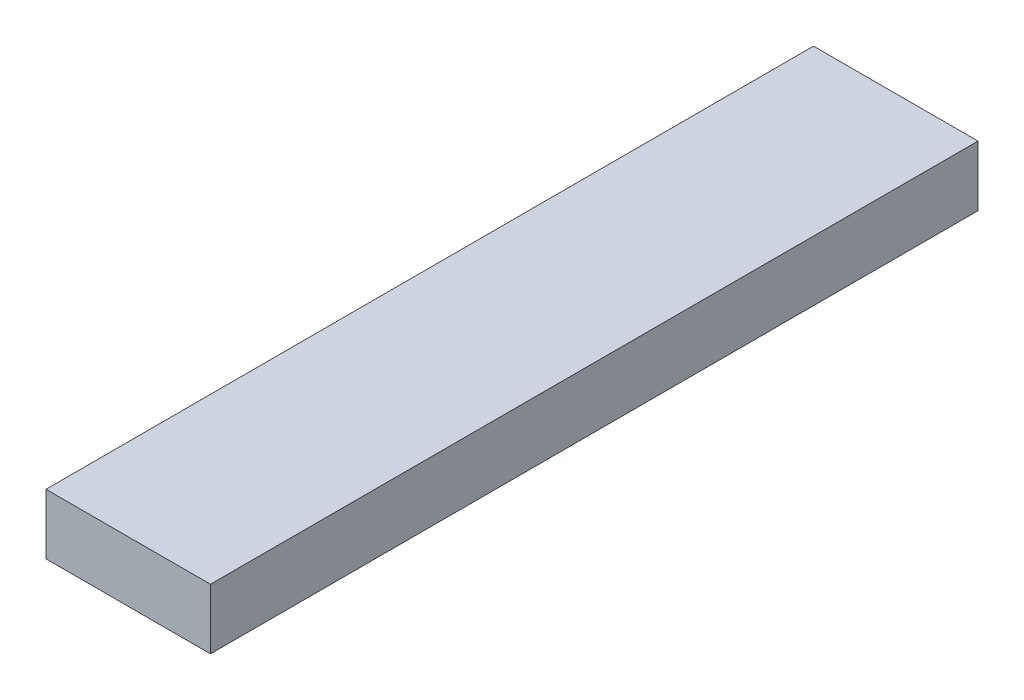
ISO-10303-21;
HEADER;
FILE_DESCRIPTION(('STEP AP214'),'2;1');
FILE_NAME('part.step','',(''),(''),'','','');
FILE_SCHEMA(('AUTOMOTIVE_DESIGN { 1 0 10303 214 1 1 1 1 }'));
ENDSEC;
DATA;
#1=APPLICATION_CONTEXT('core data for automotive mechanical design processes');
#2=APPLICATION_PROTOCOL_DEFINITION('international standard','automotive_design',2000,#1);
#3=PRODUCT_CONTEXT('',#1,'mechanical');
#4=PRODUCT('Part','Part','',(#3));
#5=PRODUCT_RELATED_PRODUCT_CATEGORY('part','',(#4));
#6=PRODUCT_DEFINITION_FORMATION('','',#4);
#7=PRODUCT_DEFINITION_CONTEXT('part definition',#1,'design');
#8=PRODUCT_DEFINITION('design','',#6,#7);
#9=PRODUCT_DEFINITION_SHAPE('','',#8);
#10=(LENGTH_UNIT() NAMED_UNIT(*) SI_UNIT(.MILLI.,.METRE.));
#11=(NAMED_UNIT(*) PLANE_ANGLE_UNIT() SI_UNIT($,.RADIAN.));
#12=(NAMED_UNIT(*) SI_UNIT($,.STERADIAN.) SOLID_ANGLE_UNIT());
#13=UNCERTAINTY_MEASURE_WITH_UNIT(LENGTH_MEASURE(1.E-05),#10,'distance_accuracy_value','');
#14=(GEOMETRIC_REPRESENTATION_CONTEXT(3) GLOBAL_UNCERTAINTY_ASSIGNED_CONTEXT((#13)) GLOBAL_UNIT_ASSIGNED_CONTEXT((#10,
#11,#12)) REPRESENTATION_CONTEXT('',''));
#15=CARTESIAN_POINT('',(0.,0.,0.));
#16=DIRECTION('',(0.,0.,1.));
#17=DIRECTION('',(1.,0.,0.));
#18=AXIS2_PLACEMENT_3D('',#15,#16,#17);
#19=CARTESIAN_POINT('',(-15.,-11.,140.));
#20=DIRECTION('',(1.,0.,0.));
#21=DIRECTION('',(0.,0.,-1.));
#22=AXIS2_PLACEMENT_3D('',#19,#20,#21);
#23=PLANE('',#22);
#24=DIRECTION('',(0.,-1.,0.));
#25=VECTOR('',#24,1.);
#26=CARTESIAN_POINT('',(-15.,-11.,0.));
#27=LINE('',#26,#25);
#28=CARTESIAN_POINT('',(-15.,0.,0.));
#29=VERTEX_POINT('',#28);
#30=CARTESIAN_POINT('',(-15.,-11.,0.));
#31=VERTEX_POINT('',#30);
#32=EDGE_CURVE('E94',#29,#31,#27,.T.);
#33=ORIENTED_EDGE('',*,*,#32,.T.);
#34=DIRECTION('',(0.,0.,-1.));
#35=VECTOR('',#34,1.);
#36=CARTESIAN_POINT('',(-15.,-11.,140.));
#37=LINE('',#36,#35);
#38=CARTESIAN_POINT('',(-15.,-11.,140.));
#39=VERTEX_POINT('',#38);
#40=EDGE_CURVE('E11',#39,#31,#37,.T.);
#41=ORIENTED_EDGE('',*,*,#40,.F.);
#42=DIRECTION('',(0.,-1.,0.));
#43=VECTOR('',#42,1.);
#44=CARTESIAN_POINT('',(-15.,-11.,140.));
#45=LINE('',#44,#43);
#46=CARTESIAN_POINT('',(-15.,0.,140.));
#47=VERTEX_POINT('',#46);
#48=EDGE_CURVE('E82',#47,#39,#45,.T.);
#49=ORIENTED_EDGE('',*,*,#48,.F.);
#50=DIRECTION('',(0.,0.,-1.));
#51=VECTOR('',#50,1.);
#52=CARTESIAN_POINT('',(-15.,0.,140.));
#53=LINE('',#52,#51);
#54=EDGE_CURVE('E90',#47,#29,#53,.T.);
#55=ORIENTED_EDGE('',*,*,#54,.T.);
#56=EDGE_LOOP('',(#33,#41,#49,#55));
#57=FACE_BOUND('',#56,.T.);
#58=ADVANCED_FACE('F31',(#57),#23,.F.);
#59=CARTESIAN_POINT('',(-15.,-11.,140.));
#60=DIRECTION('',(0.,1.,0.));
#61=DIRECTION('',(0.,0.,1.));
#62=AXIS2_PLACEMENT_3D('',#59,#60,#61);
#63=PLANE('',#62);
#64=DIRECTION('',(1.,0.,0.));
#65=VECTOR('',#64,1.);
#66=CARTESIAN_POINT('',(-15.,-11.,0.));
#67=LINE('',#66,#65);
#68=CARTESIAN_POINT('',(15.,-11.,0.));
#69=VERTEX_POINT('',#68);
#70=EDGE_CURVE('E86',#31,#69,#67,.T.);
#71=ORIENTED_EDGE('',*,*,#70,.T.);
#72=DIRECTION('',(0.,0.,-1.));
#73=VECTOR('',#72,1.);
#74=CARTESIAN_POINT('',(15.,-11.,140.));
#75=LINE('',#74,#73);
#76=CARTESIAN_POINT('',(15.,-11.,140.));
#77=VERTEX_POINT('',#76);
#78=EDGE_CURVE('E39',#77,#69,#75,.T.);
#79=ORIENTED_EDGE('',*,*,#78,.F.);
#80=DIRECTION('',(1.,0.,0.));
#81=VECTOR('',#80,1.);
#82=CARTESIAN_POINT('',(-15.,-11.,140.));
#83=LINE('',#82,#81);
#84=EDGE_CURVE('E77',#39,#77,#83,.T.);
#85=ORIENTED_EDGE('',*,*,#84,.F.);
#86=ORIENTED_EDGE('',*,*,#40,.T.);
#87=EDGE_LOOP('',(#71,#79,#85,#86));
#88=FACE_BOUND('',#87,.T.);
#89=ADVANCED_FACE('F85',(#88),#63,.F.);
#90=CARTESIAN_POINT('',(15.,-11.,140.));
#91=DIRECTION('',(-1.,0.,0.));
#92=DIRECTION('',(0.,-1.,0.));
#93=AXIS2_PLACEMENT_3D('',#90,#91,#92);
#94=PLANE('',#93);
#95=DIRECTION('',(0.,1.,0.));
#96=VECTOR('',#95,1.);
#97=CARTESIAN_POINT('',(15.,-11.,0.));
#98=LINE('',#97,#96);
#99=CARTESIAN_POINT('',(15.,0.,0.));
#100=VERTEX_POINT('',#99);
#101=EDGE_CURVE('E64',#69,#100,#98,.T.);
#102=ORIENTED_EDGE('',*,*,#101,.T.);
#103=DIRECTION('',(0.,0.,-1.));
#104=VECTOR('',#103,1.);
#105=CARTESIAN_POINT('',(15.,0.,140.));
#106=LINE('',#105,#104);
#107=CARTESIAN_POINT('',(15.,0.,140.));
#108=VERTEX_POINT('',#107);
#109=EDGE_CURVE('E87',#108,#100,#106,.T.);
#110=ORIENTED_EDGE('',*,*,#109,.F.);
#111=DIRECTION('',(0.,1.,0.));
#112=VECTOR('',#111,1.);
#113=CARTESIAN_POINT('',(15.,-11.,140.));
#114=LINE('',#113,#112);
#115=EDGE_CURVE('E80',#77,#108,#114,.T.);
#116=ORIENTED_EDGE('',*,*,#115,.F.);
#117=ORIENTED_EDGE('',*,*,#78,.T.);
#118=EDGE_LOOP('',(#102,#110,#116,#117));
#119=FACE_BOUND('',#118,.T.);
#120=ADVANCED_FACE('F88',(#119),#94,.F.);
#121=CARTESIAN_POINT('',(-15.,0.,140.));
#122=DIRECTION('',(0.,-1.,0.));
#123=DIRECTION('',(1.,0.,0.));
#124=AXIS2_PLACEMENT_3D('',#121,#122,#123);
#125=PLANE('',#124);
#126=DIRECTION('',(-1.,0.,0.));
#127=VECTOR('',#126,1.);
#128=CARTESIAN_POINT('',(-15.,0.,0.));
#129=LINE('',#128,#127);
#130=EDGE_CURVE('E70',#100,#29,#129,.T.);
#131=ORIENTED_EDGE('',*,*,#130,.T.);
#132=ORIENTED_EDGE('',*,*,#54,.F.);
#133=DIRECTION('',(-1.,0.,0.));
#134=VECTOR('',#133,1.);
#135=CARTESIAN_POINT('',(-15.,0.,140.));
#136=LINE('',#135,#134);
#137=EDGE_CURVE('E47',#108,#47,#136,.T.);
#138=ORIENTED_EDGE('',*,*,#137,.F.);
#139=ORIENTED_EDGE('',*,*,#109,.T.);
#140=EDGE_LOOP('',(#131,#132,#138,#139));
#141=FACE_BOUND('',#140,.T.);
#142=ADVANCED_FACE('F101',(#141),#125,.F.);
#143=CARTESIAN_POINT('',(-15.,-11.,140.));
#144=DIRECTION('',(0.,0.,-1.));
#145=DIRECTION('',(-1.,0.,0.));
#146=AXIS2_PLACEMENT_3D('',#143,#144,#145);
#147=PLANE('',#146);
#148=ORIENTED_EDGE('',*,*,#48,.T.);
#149=ORIENTED_EDGE('',*,*,#84,.T.);
#150=ORIENTED_EDGE('',*,*,#115,.T.);
#151=ORIENTED_EDGE('',*,*,#137,.T.);
#152=EDGE_LOOP('',(#148,#149,#150,#151));
#153=FACE_BOUND('',#152,.T.);
#154=ADVANCED_FACE('F78',(#153),#147,.F.);
#155=CARTESIAN_POINT('',(-15.,-11.,0.));
#156=DIRECTION('',(0.,0.,-1.));
#157=DIRECTION('',(-1.,0.,0.));
#158=AXIS2_PLACEMENT_3D('',#155,#156,#157);
#159=PLANE('',#158);
#160=ORIENTED_EDGE('',*,*,#32,.F.);
#161=ORIENTED_EDGE('',*,*,#130,.F.);
#162=ORIENTED_EDGE('',*,*,#101,.F.);
#163=ORIENTED_EDGE('',*,*,#70,.F.);
#164=EDGE_LOOP('',(#160,#161,#162,#163));
#165=FACE_BOUND('',#164,.T.);
#166=ADVANCED_FACE('F104',(#165),#159,.T.);
#167=CLOSED_SHELL('',(#58,#89,#120,#142,#154,#166));
#168=MANIFOLD_SOLID_BREP('B2',#167);
#169=ADVANCED_BREP_SHAPE_REPRESENTATION('',(#18,#168),#14);
#170=SHAPE_DEFINITION_REPRESENTATION(#9,#169);
ENDSEC;
END-ISO-10303-21;
